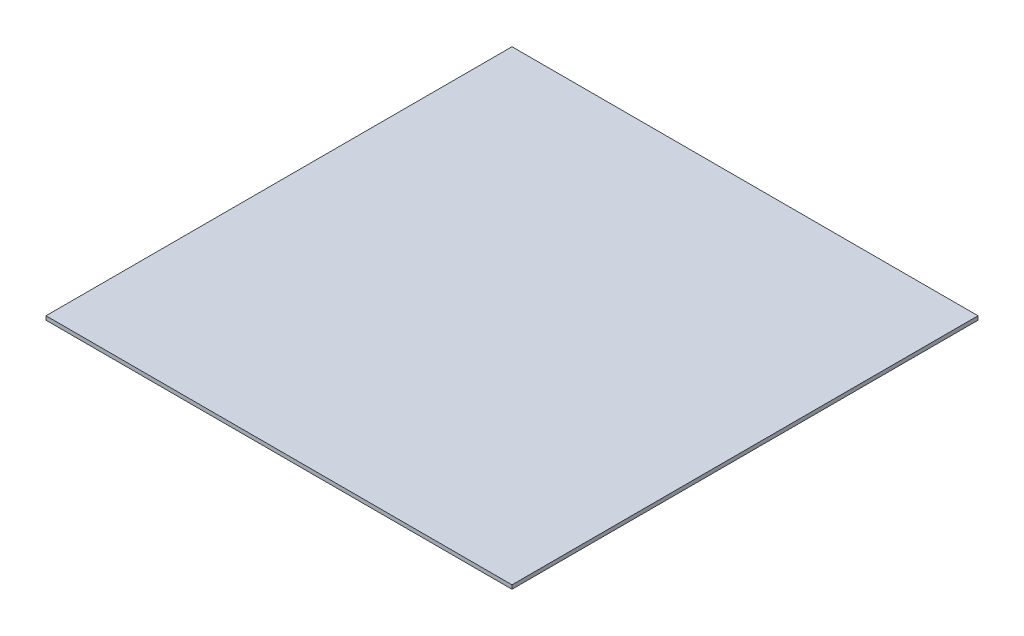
ISO-10303-21;
HEADER;
FILE_DESCRIPTION(('STEP AP214'),'2;1');
FILE_NAME('part.step','',(''),(''),'','','');
FILE_SCHEMA(('AUTOMOTIVE_DESIGN { 1 0 10303 214 1 1 1 1 }'));
ENDSEC;
DATA;
#1=APPLICATION_CONTEXT('core data for automotive mechanical design processes');
#2=APPLICATION_PROTOCOL_DEFINITION('international standard','automotive_design',2000,#1);
#3=PRODUCT_CONTEXT('',#1,'mechanical');
#4=PRODUCT('Part','Part','',(#3));
#5=PRODUCT_RELATED_PRODUCT_CATEGORY('part','',(#4));
#6=PRODUCT_DEFINITION_FORMATION('','',#4);
#7=PRODUCT_DEFINITION_CONTEXT('part definition',#1,'design');
#8=PRODUCT_DEFINITION('design','',#6,#7);
#9=PRODUCT_DEFINITION_SHAPE('','',#8);
#10=(LENGTH_UNIT() NAMED_UNIT(*) SI_UNIT(.MILLI.,.METRE.));
#11=(NAMED_UNIT(*) PLANE_ANGLE_UNIT() SI_UNIT($,.RADIAN.));
#12=(NAMED_UNIT(*) SI_UNIT($,.STERADIAN.) SOLID_ANGLE_UNIT());
#13=UNCERTAINTY_MEASURE_WITH_UNIT(LENGTH_MEASURE(1.E-05),#10,'distance_accuracy_value','');
#14=(GEOMETRIC_REPRESENTATION_CONTEXT(3) GLOBAL_UNCERTAINTY_ASSIGNED_CONTEXT((#13)) GLOBAL_UNIT_ASSIGNED_CONTEXT((#10,
#11,#12)) REPRESENTATION_CONTEXT('',''));
#15=CARTESIAN_POINT('',(0.,0.,0.));
#16=DIRECTION('',(0.,0.,1.));
#17=DIRECTION('',(1.,0.,0.));
#18=AXIS2_PLACEMENT_3D('',#15,#16,#17);
#19=CARTESIAN_POINT('',(-152.4,2.54,-152.4));
#20=DIRECTION('',(1.,0.,0.));
#21=DIRECTION('',(0.,0.,-1.));
#22=AXIS2_PLACEMENT_3D('',#19,#20,#21);
#23=PLANE('',#22);
#24=DIRECTION('',(0.,0.,1.));
#25=VECTOR('',#24,1.);
#26=CARTESIAN_POINT('',(-152.4,0.,-152.4));
#27=LINE('',#26,#25);
#28=CARTESIAN_POINT('',(-152.4,0.,-152.4));
#29=VERTEX_POINT('',#28);
#30=CARTESIAN_POINT('',(-152.4,0.,152.4));
#31=VERTEX_POINT('',#30);
#32=EDGE_CURVE('E107',#29,#31,#27,.T.);
#33=ORIENTED_EDGE('',*,*,#32,.T.);
#34=DIRECTION('',(0.,-1.,0.));
#35=VECTOR('',#34,1.);
#36=CARTESIAN_POINT('',(-152.4,2.54,152.4));
#37=LINE('',#36,#35);
#38=CARTESIAN_POINT('',(-152.4,2.54,152.4));
#39=VERTEX_POINT('',#38);
#40=EDGE_CURVE('E11',#39,#31,#37,.T.);
#41=ORIENTED_EDGE('',*,*,#40,.F.);
#42=DIRECTION('',(0.,0.,1.));
#43=VECTOR('',#42,1.);
#44=CARTESIAN_POINT('',(-152.4,2.54,-152.4));
#45=LINE('',#44,#43);
#46=CARTESIAN_POINT('',(-152.4,2.54,-152.4));
#47=VERTEX_POINT('',#46);
#48=EDGE_CURVE('E91',#47,#39,#45,.T.);
#49=ORIENTED_EDGE('',*,*,#48,.F.);
#50=DIRECTION('',(0.,-1.,0.));
#51=VECTOR('',#50,1.);
#52=CARTESIAN_POINT('',(-152.4,2.54,-152.4));
#53=LINE('',#52,#51);
#54=EDGE_CURVE('E103',#47,#29,#53,.T.);
#55=ORIENTED_EDGE('',*,*,#54,.T.);
#56=EDGE_LOOP('',(#33,#41,#49,#55));
#57=FACE_BOUND('',#56,.T.);
#58=ADVANCED_FACE('F39',(#57),#23,.F.);
#59=CARTESIAN_POINT('',(152.4,2.54,152.4));
#60=DIRECTION('',(0.,0.,-1.));
#61=DIRECTION('',(-1.,0.,0.));
#62=AXIS2_PLACEMENT_3D('',#59,#60,#61);
#63=PLANE('',#62);
#64=DIRECTION('',(1.,0.,0.));
#65=VECTOR('',#64,1.);
#66=CARTESIAN_POINT('',(152.4,0.,152.4));
#67=LINE('',#66,#65);
#68=CARTESIAN_POINT('',(152.4,0.,152.4));
#69=VERTEX_POINT('',#68);
#70=EDGE_CURVE('E96',#31,#69,#67,.T.);
#71=ORIENTED_EDGE('',*,*,#70,.T.);
#72=DIRECTION('',(0.,-1.,0.));
#73=VECTOR('',#72,1.);
#74=CARTESIAN_POINT('',(152.4,2.54,152.4));
#75=LINE('',#74,#73);
#76=CARTESIAN_POINT('',(152.4,2.54,152.4));
#77=VERTEX_POINT('',#76);
#78=EDGE_CURVE('E48',#77,#69,#75,.T.);
#79=ORIENTED_EDGE('',*,*,#78,.F.);
#80=DIRECTION('',(1.,0.,0.));
#81=VECTOR('',#80,1.);
#82=CARTESIAN_POINT('',(152.4,2.54,152.4));
#83=LINE('',#82,#81);
#84=EDGE_CURVE('E86',#39,#77,#83,.T.);
#85=ORIENTED_EDGE('',*,*,#84,.F.);
#86=ORIENTED_EDGE('',*,*,#40,.T.);
#87=EDGE_LOOP('',(#71,#79,#85,#86));
#88=FACE_BOUND('',#87,.T.);
#89=ADVANCED_FACE('F95',(#88),#63,.F.);
#90=CARTESIAN_POINT('',(152.4,2.54,-152.4));
#91=DIRECTION('',(-1.,0.,0.));
#92=DIRECTION('',(0.,0.,1.));
#93=AXIS2_PLACEMENT_3D('',#90,#91,#92);
#94=PLANE('',#93);
#95=DIRECTION('',(0.,0.,-1.));
#96=VECTOR('',#95,1.);
#97=CARTESIAN_POINT('',(152.4,0.,-152.4));
#98=LINE('',#97,#96);
#99=CARTESIAN_POINT('',(152.4,0.,-152.4));
#100=VERTEX_POINT('',#99);
#101=EDGE_CURVE('E73',#69,#100,#98,.T.);
#102=ORIENTED_EDGE('',*,*,#101,.T.);
#103=DIRECTION('',(0.,-1.,0.));
#104=VECTOR('',#103,1.);
#105=CARTESIAN_POINT('',(152.4,2.54,-152.4));
#106=LINE('',#105,#104);
#107=CARTESIAN_POINT('',(152.4,2.54,-152.4));
#108=VERTEX_POINT('',#107);
#109=EDGE_CURVE('E98',#108,#100,#106,.T.);
#110=ORIENTED_EDGE('',*,*,#109,.F.);
#111=DIRECTION('',(0.,0.,-1.));
#112=VECTOR('',#111,1.);
#113=CARTESIAN_POINT('',(152.4,2.54,-152.4));
#114=LINE('',#113,#112);
#115=EDGE_CURVE('E89',#77,#108,#114,.T.);
#116=ORIENTED_EDGE('',*,*,#115,.F.);
#117=ORIENTED_EDGE('',*,*,#78,.T.);
#118=EDGE_LOOP('',(#102,#110,#116,#117));
#119=FACE_BOUND('',#118,.T.);
#120=ADVANCED_FACE('F99',(#119),#94,.F.);
#121=CARTESIAN_POINT('',(152.4,2.54,-152.4));
#122=DIRECTION('',(0.,0.,1.));
#123=DIRECTION('',(1.,0.,0.));
#124=AXIS2_PLACEMENT_3D('',#121,#122,#123);
#125=PLANE('',#124);
#126=DIRECTION('',(-1.,0.,0.));
#127=VECTOR('',#126,1.);
#128=CARTESIAN_POINT('',(152.4,0.,-152.4));
#129=LINE('',#128,#127);
#130=EDGE_CURVE('E79',#100,#29,#129,.T.);
#131=ORIENTED_EDGE('',*,*,#130,.T.);
#132=ORIENTED_EDGE('',*,*,#54,.F.);
#133=DIRECTION('',(-1.,0.,0.));
#134=VECTOR('',#133,1.);
#135=CARTESIAN_POINT('',(152.4,2.54,-152.4));
#136=LINE('',#135,#134);
#137=EDGE_CURVE('E56',#108,#47,#136,.T.);
#138=ORIENTED_EDGE('',*,*,#137,.F.);
#139=ORIENTED_EDGE('',*,*,#109,.T.);
#140=EDGE_LOOP('',(#131,#132,#138,#139));
#141=FACE_BOUND('',#140,.T.);
#142=ADVANCED_FACE('F120',(#141),#125,.F.);
#143=CARTESIAN_POINT('',(0.,2.54,0.));
#144=DIRECTION('',(0.,-1.,0.));
#145=DIRECTION('',(0.,0.,-1.));
#146=AXIS2_PLACEMENT_3D('',#143,#144,#145);
#147=PLANE('',#146);
#148=ORIENTED_EDGE('',*,*,#48,.T.);
#149=ORIENTED_EDGE('',*,*,#84,.T.);
#150=ORIENTED_EDGE('',*,*,#115,.T.);
#151=ORIENTED_EDGE('',*,*,#137,.T.);
#152=EDGE_LOOP('',(#148,#149,#150,#151));
#153=FACE_BOUND('',#152,.T.);
#154=ADVANCED_FACE('F87',(#153),#147,.F.);
#155=CARTESIAN_POINT('',(0.,0.,0.));
#156=DIRECTION('',(0.,-1.,0.));
#157=DIRECTION('',(0.,0.,-1.));
#158=AXIS2_PLACEMENT_3D('',#155,#156,#157);
#159=PLANE('',#158);
#160=ORIENTED_EDGE('',*,*,#32,.F.);
#161=ORIENTED_EDGE('',*,*,#130,.F.);
#162=ORIENTED_EDGE('',*,*,#101,.F.);
#163=ORIENTED_EDGE('',*,*,#70,.F.);
#164=EDGE_LOOP('',(#160,#161,#162,#163));
#165=FACE_BOUND('',#164,.T.);
#166=ADVANCED_FACE('F123',(#165),#159,.T.);
#167=CLOSED_SHELL('',(#58,#89,#120,#142,#154,#166));
#168=MANIFOLD_SOLID_BREP('B2',#167);
#169=ADVANCED_BREP_SHAPE_REPRESENTATION('',(#18,#168),#14);
#170=SHAPE_DEFINITION_REPRESENTATION(#9,#169);
ENDSEC;
END-ISO-10303-21;
